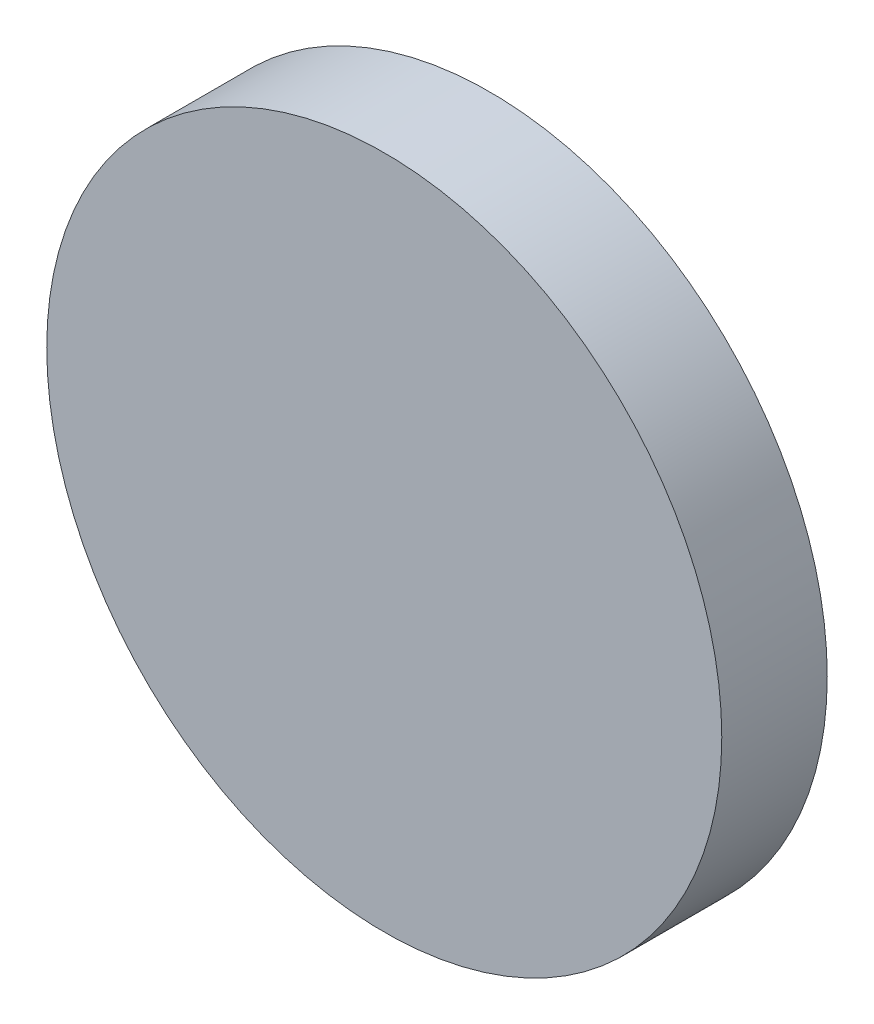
ISO-10303-21;
HEADER;
FILE_DESCRIPTION(('STEP AP214'),'2;1');
FILE_NAME('part.step','',(''),(''),'','','');
FILE_SCHEMA(('AUTOMOTIVE_DESIGN { 1 0 10303 214 1 1 1 1 }'));
ENDSEC;
DATA;
#1=APPLICATION_CONTEXT('core data for automotive mechanical design processes');
#2=APPLICATION_PROTOCOL_DEFINITION('international standard','automotive_design',2000,#1);
#3=PRODUCT_CONTEXT('',#1,'mechanical');
#4=PRODUCT('Part','Part','',(#3));
#5=PRODUCT_RELATED_PRODUCT_CATEGORY('part','',(#4));
#6=PRODUCT_DEFINITION_FORMATION('','',#4);
#7=PRODUCT_DEFINITION_CONTEXT('part definition',#1,'design');
#8=PRODUCT_DEFINITION('design','',#6,#7);
#9=PRODUCT_DEFINITION_SHAPE('','',#8);
#10=(LENGTH_UNIT() NAMED_UNIT(*) SI_UNIT(.MILLI.,.METRE.));
#11=(NAMED_UNIT(*) PLANE_ANGLE_UNIT() SI_UNIT($,.RADIAN.));
#12=(NAMED_UNIT(*) SI_UNIT($,.STERADIAN.) SOLID_ANGLE_UNIT());
#13=UNCERTAINTY_MEASURE_WITH_UNIT(LENGTH_MEASURE(1.E-05),#10,'distance_accuracy_value','');
#14=(GEOMETRIC_REPRESENTATION_CONTEXT(3) GLOBAL_UNCERTAINTY_ASSIGNED_CONTEXT((#13)) GLOBAL_UNIT_ASSIGNED_CONTEXT((#10,
#11,#12)) REPRESENTATION_CONTEXT('',''));
#15=CARTESIAN_POINT('',(0.,0.,0.));
#16=DIRECTION('',(0.,0.,1.));
#17=DIRECTION('',(1.,0.,0.));
#18=AXIS2_PLACEMENT_3D('',#15,#16,#17);
#19=CARTESIAN_POINT('',(0.,0.,2.));
#20=DIRECTION('',(0.,0.,-1.));
#21=DIRECTION('',(-1.,0.,0.));
#22=AXIS2_PLACEMENT_3D('',#19,#20,#21);
#23=CYLINDRICAL_SURFACE('',#22,6.4);
#24=CARTESIAN_POINT('',(0.,0.,2.));
#25=DIRECTION('',(0.,0.,1.));
#26=DIRECTION('',(1.,0.,0.));
#27=AXIS2_PLACEMENT_3D('',#24,#25,#26);
#28=CIRCLE('',#27,6.4);
#29=CARTESIAN_POINT('',(6.4,0.,2.));
#30=VERTEX_POINT('',#29);
#31=EDGE_CURVE('E10',#30,#30,#28,.T.);
#32=ORIENTED_EDGE('',*,*,#31,.F.);
#33=EDGE_LOOP('',(#32));
#34=FACE_BOUND('',#33,.T.);
#35=CARTESIAN_POINT('',(0.,0.,0.));
#36=DIRECTION('',(0.,0.,1.));
#37=DIRECTION('',(1.,0.,0.));
#38=AXIS2_PLACEMENT_3D('',#35,#36,#37);
#39=CIRCLE('',#38,6.4);
#40=CARTESIAN_POINT('',(6.4,0.,0.));
#41=VERTEX_POINT('',#40);
#42=EDGE_CURVE('E33',#41,#41,#39,.T.);
#43=ORIENTED_EDGE('',*,*,#42,.T.);
#44=EDGE_LOOP('',(#43));
#45=FACE_BOUND('',#44,.T.);
#46=ADVANCED_FACE('F30',(#34,#45),#23,.T.);
#47=CARTESIAN_POINT('',(0.,0.,2.));
#48=DIRECTION('',(0.,0.,1.));
#49=DIRECTION('',(1.,0.,0.));
#50=AXIS2_PLACEMENT_3D('',#47,#48,#49);
#51=PLANE('',#50);
#52=ORIENTED_EDGE('',*,*,#31,.T.);
#53=EDGE_LOOP('',(#52));
#54=FACE_BOUND('',#53,.T.);
#55=ADVANCED_FACE('F45',(#54),#51,.T.);
#56=CARTESIAN_POINT('',(0.,0.,0.));
#57=DIRECTION('',(0.,0.,1.));
#58=DIRECTION('',(1.,0.,0.));
#59=AXIS2_PLACEMENT_3D('',#56,#57,#58);
#60=PLANE('',#59);
#61=ORIENTED_EDGE('',*,*,#42,.F.);
#62=EDGE_LOOP('',(#61));
#63=FACE_BOUND('',#62,.T.);
#64=ADVANCED_FACE('F43',(#63),#60,.F.);
#65=CLOSED_SHELL('',(#46,#55,#64));
#66=MANIFOLD_SOLID_BREP('B2',#65);
#67=ADVANCED_BREP_SHAPE_REPRESENTATION('',(#18,#66),#14);
#68=SHAPE_DEFINITION_REPRESENTATION(#9,#67);
ENDSEC;
END-ISO-10303-21;
